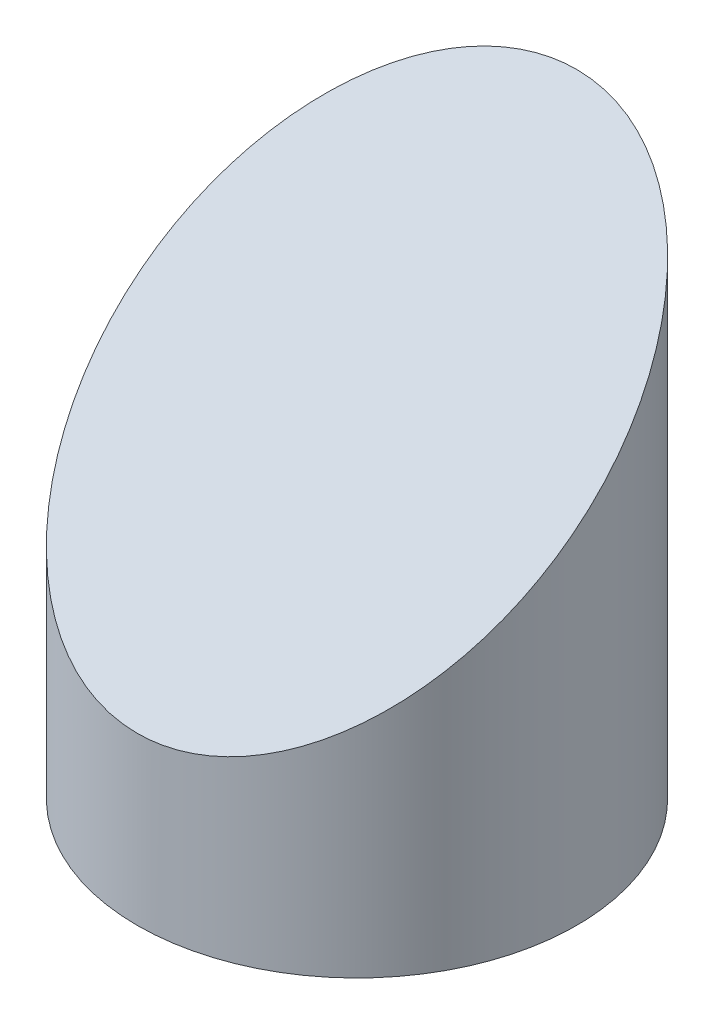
from build123d import *

# Parameters (mm, degrees)
SKETCH_1_W               = 25
SKETCH_1_H               = 80
CUT_EXTRUDE_1_DEPTH      = 88.464278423
CUT_EXTRUDE_1_DEPTH_BACK = 88.464278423


with BuildPart() as part:
    # Sketch 1 → Revolve 1 (revolve)
    with BuildSketch(Plane(origin=(0, 0, 0), x_dir=(0, 0, -1), z_dir=(1, 0, 0))):
        with Locations((12.5, 40)):
            Rectangle(SKETCH_1_W, SKETCH_1_H)
    revolve(axis=Axis((0, 0, 0), (0, 1, 0)))

    # Sketch 3 → Cut-Extrude 1 (cut, two sides: drawn at the far end of the back side and taken through both)
    with BuildSketch(Plane(origin=(0, 0, 0), x_dir=(0, 0, -1), z_dir=(1, 0, 0)).offset(-CUT_EXTRUDE_1_DEPTH_BACK)):
        Polygon((25, 59.387366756), (-25, 18.935488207), (-25, 91.34778949), (25, 91.34778949), align=None)
    extrude(amount=CUT_EXTRUDE_1_DEPTH + CUT_EXTRUDE_1_DEPTH_BACK, mode=Mode.SUBTRACT)


solid = part.part
